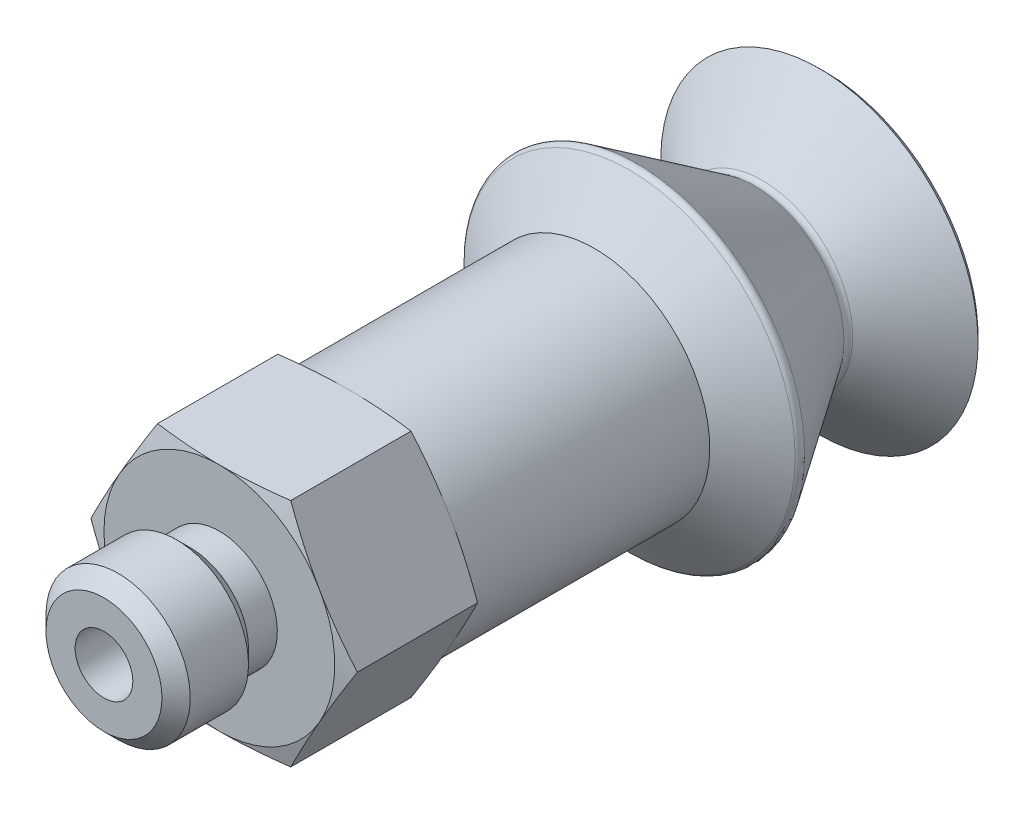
ISO-10303-21;
HEADER;
FILE_DESCRIPTION(('STEP AP214'),'2;1');
FILE_NAME('part.step','',(''),(''),'','','');
FILE_SCHEMA(('AUTOMOTIVE_DESIGN { 1 0 10303 214 1 1 1 1 }'));
ENDSEC;
DATA;
#1=APPLICATION_CONTEXT('core data for automotive mechanical design processes');
#2=APPLICATION_PROTOCOL_DEFINITION('international standard','automotive_design',2000,#1);
#3=PRODUCT_CONTEXT('',#1,'mechanical');
#4=PRODUCT('Part','Part','',(#3));
#5=PRODUCT_RELATED_PRODUCT_CATEGORY('part','',(#4));
#6=PRODUCT_DEFINITION_FORMATION('','',#4);
#7=PRODUCT_DEFINITION_CONTEXT('part definition',#1,'design');
#8=PRODUCT_DEFINITION('design','',#6,#7);
#9=PRODUCT_DEFINITION_SHAPE('','',#8);
#10=(LENGTH_UNIT() NAMED_UNIT(*) SI_UNIT(.MILLI.,.METRE.));
#11=(NAMED_UNIT(*) PLANE_ANGLE_UNIT() SI_UNIT($,.RADIAN.));
#12=(NAMED_UNIT(*) SI_UNIT($,.STERADIAN.) SOLID_ANGLE_UNIT());
#13=UNCERTAINTY_MEASURE_WITH_UNIT(LENGTH_MEASURE(1.E-05),#10,'distance_accuracy_value','');
#14=(GEOMETRIC_REPRESENTATION_CONTEXT(3) GLOBAL_UNCERTAINTY_ASSIGNED_CONTEXT((#13)) GLOBAL_UNIT_ASSIGNED_CONTEXT((#10,
#11,#12)) REPRESENTATION_CONTEXT('',''));
#15=CARTESIAN_POINT('',(0.,0.,0.));
#16=DIRECTION('',(0.,0.,1.));
#17=DIRECTION('',(1.,0.,0.));
#18=AXIS2_PLACEMENT_3D('',#15,#16,#17);
#19=CARTESIAN_POINT('',(4.61880215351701,0.,21.));
#20=DIRECTION('',(-0.866025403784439,-0.5,0.));
#21=DIRECTION('',(0.,0.,-1.));
#22=AXIS2_PLACEMENT_3D('',#19,#20,#21);
#23=PLANE('',#22);
#24=CARTESIAN_POINT('',(4.61880215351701,0.,16.6658075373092));
#25=CARTESIAN_POINT('',(4.0000000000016,1.07179676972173,16.5));
#26=CARTESIAN_POINT('',(3.46410161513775,2.00000000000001,16.5));
#27=B_SPLINE_CURVE_WITH_KNOTS('',2,(#24,#25,#26),.UNSPECIFIED.,.F.,.F.,(3,3),(0.,1.),.UNSPECIFIED.);
#28=CARTESIAN_POINT('',(4.61880215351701,0.,16.6658075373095));
#29=VERTEX_POINT('',#28);
#30=CARTESIAN_POINT('',(3.46410161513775,2.,16.5));
#31=VERTEX_POINT('',#30);
#32=EDGE_CURVE('E310',#29,#31,#27,.T.);
#33=ORIENTED_EDGE('',*,*,#32,.T.);
#34=CARTESIAN_POINT('',(3.46410161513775,2.00000000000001,16.5));
#35=CARTESIAN_POINT('',(2.92820323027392,2.92820323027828,16.5));
#36=CARTESIAN_POINT('',(2.30940107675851,4.,16.6658075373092));
#37=B_SPLINE_CURVE_WITH_KNOTS('',2,(#34,#35,#36),.UNSPECIFIED.,.F.,.F.,(3,3),(0.,1.),.UNSPECIFIED.);
#38=CARTESIAN_POINT('',(2.3094010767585,4.,16.6658075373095));
#39=VERTEX_POINT('',#38);
#40=EDGE_CURVE('E636',#31,#39,#37,.T.);
#41=ORIENTED_EDGE('',*,*,#40,.T.);
#42=DIRECTION('',(0.,0.,-1.));
#43=VECTOR('',#42,1.);
#44=CARTESIAN_POINT('',(2.3094010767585,4.,21.));
#45=LINE('',#44,#43);
#46=CARTESIAN_POINT('',(2.3094010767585,4.,20.8341924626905));
#47=VERTEX_POINT('',#46);
#48=EDGE_CURVE('E10',#47,#39,#45,.T.);
#49=ORIENTED_EDGE('',*,*,#48,.F.);
#50=CARTESIAN_POINT('',(2.30940107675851,4.,20.8341924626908));
#51=CARTESIAN_POINT('',(2.92820323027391,2.92820323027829,21.));
#52=CARTESIAN_POINT('',(3.46410161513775,2.00000000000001,21.));
#53=B_SPLINE_CURVE_WITH_KNOTS('',2,(#50,#51,#52),.UNSPECIFIED.,.F.,.F.,(3,3),(0.,1.),.UNSPECIFIED.);
#54=CARTESIAN_POINT('',(3.46410161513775,2.,21.));
#55=VERTEX_POINT('',#54);
#56=EDGE_CURVE('E224',#47,#55,#53,.T.);
#57=ORIENTED_EDGE('',*,*,#56,.T.);
#58=CARTESIAN_POINT('',(3.46410161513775,2.00000000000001,21.));
#59=CARTESIAN_POINT('',(4.00000000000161,1.07179676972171,21.));
#60=CARTESIAN_POINT('',(4.61880215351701,0.,20.8341924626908));
#61=B_SPLINE_CURVE_WITH_KNOTS('',2,(#58,#59,#60),.UNSPECIFIED.,.F.,.F.,(3,3),(0.,1.),.UNSPECIFIED.);
#62=CARTESIAN_POINT('',(4.61880215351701,0.,20.8341924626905));
#63=VERTEX_POINT('',#62);
#64=EDGE_CURVE('E272',#55,#63,#61,.T.);
#65=ORIENTED_EDGE('',*,*,#64,.T.);
#66=DIRECTION('',(0.,0.,-1.));
#67=VECTOR('',#66,1.);
#68=CARTESIAN_POINT('',(4.61880215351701,0.,21.));
#69=LINE('',#68,#67);
#70=EDGE_CURVE('E277',#63,#29,#69,.T.);
#71=ORIENTED_EDGE('',*,*,#70,.T.);
#72=EDGE_LOOP('',(#33,#41,#49,#57,#65,#71));
#73=FACE_BOUND('',#72,.T.);
#74=ADVANCED_FACE('F15',(#73),#23,.F.);
#75=CARTESIAN_POINT('',(2.3094010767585,4.,21.));
#76=DIRECTION('',(0.,-1.,0.));
#77=DIRECTION('',(0.,0.,-1.));
#78=AXIS2_PLACEMENT_3D('',#75,#76,#77);
#79=PLANE('',#78);
#80=CARTESIAN_POINT('',(2.3094010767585,4.,16.6658075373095));
#81=CARTESIAN_POINT('',(1.07179676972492,4.,16.5));
#82=CARTESIAN_POINT('',(0.,4.,16.5));
#83=B_SPLINE_CURVE_WITH_KNOTS('',2,(#80,#81,#82),.UNSPECIFIED.,.F.,.F.,(3,3),(0.,1.),.UNSPECIFIED.);
#84=CARTESIAN_POINT('',(0.,4.,16.5));
#85=VERTEX_POINT('',#84);
#86=EDGE_CURVE('E631',#39,#85,#83,.T.);
#87=ORIENTED_EDGE('',*,*,#86,.T.);
#88=CARTESIAN_POINT('',(0.,4.,16.5));
#89=CARTESIAN_POINT('',(-1.07179676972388,4.,16.5));
#90=CARTESIAN_POINT('',(-2.3094010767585,4.,16.6658075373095));
#91=B_SPLINE_CURVE_WITH_KNOTS('',2,(#88,#89,#90),.UNSPECIFIED.,.F.,.F.,(3,3),(0.,1.),.UNSPECIFIED.);
#92=CARTESIAN_POINT('',(-2.3094010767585,4.,16.6658075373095));
#93=VERTEX_POINT('',#92);
#94=EDGE_CURVE('E362',#85,#93,#91,.T.);
#95=ORIENTED_EDGE('',*,*,#94,.T.);
#96=DIRECTION('',(0.,0.,-1.));
#97=VECTOR('',#96,1.);
#98=CARTESIAN_POINT('',(-2.3094010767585,4.,21.));
#99=LINE('',#98,#97);
#100=CARTESIAN_POINT('',(-2.3094010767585,4.,20.8341924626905));
#101=VERTEX_POINT('',#100);
#102=EDGE_CURVE('E28',#101,#93,#99,.T.);
#103=ORIENTED_EDGE('',*,*,#102,.F.);
#104=CARTESIAN_POINT('',(-2.3094010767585,4.,20.8341924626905));
#105=CARTESIAN_POINT('',(-1.07179676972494,4.,21.));
#106=CARTESIAN_POINT('',(0.,4.,21.));
#107=B_SPLINE_CURVE_WITH_KNOTS('',2,(#104,#105,#106),.UNSPECIFIED.,.F.,.F.,(3,3),(0.,1.),.UNSPECIFIED.);
#108=CARTESIAN_POINT('',(0.,4.,21.));
#109=VERTEX_POINT('',#108);
#110=EDGE_CURVE('E414',#101,#109,#107,.T.);
#111=ORIENTED_EDGE('',*,*,#110,.T.);
#112=CARTESIAN_POINT('',(0.,4.,21.));
#113=CARTESIAN_POINT('',(1.07179676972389,4.,21.));
#114=CARTESIAN_POINT('',(2.30940107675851,4.,20.8341924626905));
#115=B_SPLINE_CURVE_WITH_KNOTS('',2,(#112,#113,#114),.UNSPECIFIED.,.F.,.F.,(3,3),(0.,1.),.UNSPECIFIED.);
#116=EDGE_CURVE('E756',#109,#47,#115,.T.);
#117=ORIENTED_EDGE('',*,*,#116,.T.);
#118=ORIENTED_EDGE('',*,*,#48,.T.);
#119=EDGE_LOOP('',(#87,#95,#103,#111,#117,#118));
#120=FACE_BOUND('',#119,.T.);
#121=ADVANCED_FACE('F240',(#120),#79,.F.);
#122=CARTESIAN_POINT('',(-2.3094010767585,4.,21.));
#123=DIRECTION('',(0.866025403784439,-0.5,0.));
#124=DIRECTION('',(0.5,0.866025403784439,0.));
#125=AXIS2_PLACEMENT_3D('',#122,#123,#124);
#126=PLANE('',#125);
#127=CARTESIAN_POINT('',(-2.3094010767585,4.,16.6658075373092));
#128=CARTESIAN_POINT('',(-2.92820323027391,2.92820323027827,16.5));
#129=CARTESIAN_POINT('',(-3.46410161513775,1.99999999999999,16.5));
#130=B_SPLINE_CURVE_WITH_KNOTS('',2,(#127,#128,#129),.UNSPECIFIED.,.F.,.F.,(3,3),(0.,1.),.UNSPECIFIED.);
#131=CARTESIAN_POINT('',(-3.46410161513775,2.,16.5));
#132=VERTEX_POINT('',#131);
#133=EDGE_CURVE('E540',#93,#132,#130,.T.);
#134=ORIENTED_EDGE('',*,*,#133,.T.);
#135=CARTESIAN_POINT('',(-3.46410161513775,2.,16.5));
#136=CARTESIAN_POINT('',(-4.0000000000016,1.07179676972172,16.5));
#137=CARTESIAN_POINT('',(-4.618802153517,0.,16.6658075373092));
#138=B_SPLINE_CURVE_WITH_KNOTS('',2,(#135,#136,#137),.UNSPECIFIED.,.F.,.F.,(3,3),(0.,1.),.UNSPECIFIED.);
#139=CARTESIAN_POINT('',(-4.61880215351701,0.,16.6658075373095));
#140=VERTEX_POINT('',#139);
#141=EDGE_CURVE('E554',#132,#140,#138,.T.);
#142=ORIENTED_EDGE('',*,*,#141,.T.);
#143=DIRECTION('',(0.,0.,-1.));
#144=VECTOR('',#143,1.);
#145=CARTESIAN_POINT('',(-4.61880215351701,0.,21.));
#146=LINE('',#145,#144);
#147=CARTESIAN_POINT('',(-4.61880215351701,0.,20.8341924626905));
#148=VERTEX_POINT('',#147);
#149=EDGE_CURVE('E491',#148,#140,#146,.T.);
#150=ORIENTED_EDGE('',*,*,#149,.F.);
#151=CARTESIAN_POINT('',(-4.618802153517,0.,20.8341924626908));
#152=CARTESIAN_POINT('',(-4.0000000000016,1.07179676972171,21.));
#153=CARTESIAN_POINT('',(-3.46410161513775,2.,21.));
#154=B_SPLINE_CURVE_WITH_KNOTS('',2,(#151,#152,#153),.UNSPECIFIED.,.F.,.F.,(3,3),(0.,1.),.UNSPECIFIED.);
#155=CARTESIAN_POINT('',(-3.46410161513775,2.,21.));
#156=VERTEX_POINT('',#155);
#157=EDGE_CURVE('E501',#148,#156,#154,.T.);
#158=ORIENTED_EDGE('',*,*,#157,.T.);
#159=CARTESIAN_POINT('',(-3.46410161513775,2.,21.));
#160=CARTESIAN_POINT('',(-2.9282032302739,2.9282032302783,21.));
#161=CARTESIAN_POINT('',(-2.3094010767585,4.,20.8341924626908));
#162=B_SPLINE_CURVE_WITH_KNOTS('',2,(#159,#160,#161),.UNSPECIFIED.,.F.,.F.,(3,3),(0.,1.),.UNSPECIFIED.);
#163=EDGE_CURVE('E454',#156,#101,#162,.T.);
#164=ORIENTED_EDGE('',*,*,#163,.T.);
#165=ORIENTED_EDGE('',*,*,#102,.T.);
#166=EDGE_LOOP('',(#134,#142,#150,#158,#164,#165));
#167=FACE_BOUND('',#166,.T.);
#168=ADVANCED_FACE('F378',(#167),#126,.F.);
#169=CARTESIAN_POINT('',(-4.61880215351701,0.,21.));
#170=DIRECTION('',(0.866025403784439,0.5,0.));
#171=DIRECTION('',(0.,0.,1.));
#172=AXIS2_PLACEMENT_3D('',#169,#170,#171);
#173=PLANE('',#172);
#174=CARTESIAN_POINT('',(-4.61880215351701,0.,16.6658075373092));
#175=CARTESIAN_POINT('',(-4.0000000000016,-1.07179676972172,16.5));
#176=CARTESIAN_POINT('',(-3.46410161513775,-2.00000000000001,16.5));
#177=B_SPLINE_CURVE_WITH_KNOTS('',2,(#174,#175,#176),.UNSPECIFIED.,.F.,.F.,(3,3),(0.,1.),.UNSPECIFIED.);
#178=CARTESIAN_POINT('',(-3.46410161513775,-2.,16.5));
#179=VERTEX_POINT('',#178);
#180=EDGE_CURVE('E553',#140,#179,#177,.T.);
#181=ORIENTED_EDGE('',*,*,#180,.T.);
#182=CARTESIAN_POINT('',(-3.46410161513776,-2.,16.5));
#183=CARTESIAN_POINT('',(-2.92820323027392,-2.92820323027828,16.5));
#184=CARTESIAN_POINT('',(-2.30940107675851,-4.,16.6658075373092));
#185=B_SPLINE_CURVE_WITH_KNOTS('',2,(#182,#183,#184),.UNSPECIFIED.,.F.,.F.,(3,3),(0.,1.),.UNSPECIFIED.);
#186=CARTESIAN_POINT('',(-2.3094010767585,-4.,16.6658075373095));
#187=VERTEX_POINT('',#186);
#188=EDGE_CURVE('E698',#179,#187,#185,.T.);
#189=ORIENTED_EDGE('',*,*,#188,.T.);
#190=DIRECTION('',(0.,0.,-1.));
#191=VECTOR('',#190,1.);
#192=CARTESIAN_POINT('',(-2.3094010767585,-4.,21.));
#193=LINE('',#192,#191);
#194=CARTESIAN_POINT('',(-2.3094010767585,-4.,20.8341924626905));
#195=VERTEX_POINT('',#194);
#196=EDGE_CURVE('E494',#195,#187,#193,.T.);
#197=ORIENTED_EDGE('',*,*,#196,.F.);
#198=CARTESIAN_POINT('',(-2.30940107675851,-4.,20.8341924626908));
#199=CARTESIAN_POINT('',(-2.92820323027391,-2.92820323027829,21.));
#200=CARTESIAN_POINT('',(-3.46410161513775,-2.00000000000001,21.));
#201=B_SPLINE_CURVE_WITH_KNOTS('',2,(#198,#199,#200),.UNSPECIFIED.,.F.,.F.,(3,3),(0.,1.),.UNSPECIFIED.);
#202=CARTESIAN_POINT('',(-3.46410161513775,-2.,21.));
#203=VERTEX_POINT('',#202);
#204=EDGE_CURVE('E487',#195,#203,#201,.T.);
#205=ORIENTED_EDGE('',*,*,#204,.T.);
#206=CARTESIAN_POINT('',(-3.46410161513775,-2.00000000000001,21.));
#207=CARTESIAN_POINT('',(-4.00000000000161,-1.07179676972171,21.));
#208=CARTESIAN_POINT('',(-4.61880215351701,0.,20.8341924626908));
#209=B_SPLINE_CURVE_WITH_KNOTS('',2,(#206,#207,#208),.UNSPECIFIED.,.F.,.F.,(3,3),(0.,1.),.UNSPECIFIED.);
#210=EDGE_CURVE('E455',#203,#148,#209,.T.);
#211=ORIENTED_EDGE('',*,*,#210,.T.);
#212=ORIENTED_EDGE('',*,*,#149,.T.);
#213=EDGE_LOOP('',(#181,#189,#197,#205,#211,#212));
#214=FACE_BOUND('',#213,.T.);
#215=ADVANCED_FACE('F433',(#214),#173,.F.);
#216=CARTESIAN_POINT('',(-2.3094010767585,-4.,21.));
#217=DIRECTION('',(0.,1.,0.));
#218=DIRECTION('',(-1.,0.,0.));
#219=AXIS2_PLACEMENT_3D('',#216,#217,#218);
#220=PLANE('',#219);
#221=CARTESIAN_POINT('',(-2.3094010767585,-4.,16.6658075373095));
#222=CARTESIAN_POINT('',(-1.07179676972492,-4.,16.5));
#223=CARTESIAN_POINT('',(0.,-4.,16.5));
#224=B_SPLINE_CURVE_WITH_KNOTS('',2,(#221,#222,#223),.UNSPECIFIED.,.F.,.F.,(3,3),(0.,1.),.UNSPECIFIED.);
#225=CARTESIAN_POINT('',(0.,-4.,16.5));
#226=VERTEX_POINT('',#225);
#227=EDGE_CURVE('E1159',#187,#226,#224,.T.);
#228=ORIENTED_EDGE('',*,*,#227,.T.);
#229=CARTESIAN_POINT('',(0.,-4.,16.5));
#230=CARTESIAN_POINT('',(1.07179676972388,-4.,16.5));
#231=CARTESIAN_POINT('',(2.3094010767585,-4.,16.6658075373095));
#232=B_SPLINE_CURVE_WITH_KNOTS('',2,(#229,#230,#231),.UNSPECIFIED.,.F.,.F.,(3,3),(0.,1.),.UNSPECIFIED.);
#233=CARTESIAN_POINT('',(2.3094010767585,-4.,16.6658075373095));
#234=VERTEX_POINT('',#233);
#235=EDGE_CURVE('E355',#226,#234,#232,.T.);
#236=ORIENTED_EDGE('',*,*,#235,.T.);
#237=DIRECTION('',(0.,0.,-1.));
#238=VECTOR('',#237,1.);
#239=CARTESIAN_POINT('',(2.3094010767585,-4.,21.));
#240=LINE('',#239,#238);
#241=CARTESIAN_POINT('',(2.3094010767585,-4.,20.8341924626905));
#242=VERTEX_POINT('',#241);
#243=EDGE_CURVE('E693',#242,#234,#240,.T.);
#244=ORIENTED_EDGE('',*,*,#243,.F.);
#245=CARTESIAN_POINT('',(2.3094010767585,-4.,20.8341924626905));
#246=CARTESIAN_POINT('',(1.07179676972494,-4.,21.));
#247=CARTESIAN_POINT('',(0.,-4.,21.));
#248=B_SPLINE_CURVE_WITH_KNOTS('',2,(#245,#246,#247),.UNSPECIFIED.,.F.,.F.,(3,3),(0.,1.),.UNSPECIFIED.);
#249=CARTESIAN_POINT('',(0.,-4.,21.));
#250=VERTEX_POINT('',#249);
#251=EDGE_CURVE('E691',#242,#250,#248,.T.);
#252=ORIENTED_EDGE('',*,*,#251,.T.);
#253=CARTESIAN_POINT('',(0.,-4.,21.));
#254=CARTESIAN_POINT('',(-1.07179676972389,-4.,21.));
#255=CARTESIAN_POINT('',(-2.30940107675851,-4.,20.8341924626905));
#256=B_SPLINE_CURVE_WITH_KNOTS('',2,(#253,#254,#255),.UNSPECIFIED.,.F.,.F.,(3,3),(0.,1.),.UNSPECIFIED.);
#257=EDGE_CURVE('E488',#250,#195,#256,.T.);
#258=ORIENTED_EDGE('',*,*,#257,.T.);
#259=ORIENTED_EDGE('',*,*,#196,.T.);
#260=EDGE_LOOP('',(#228,#236,#244,#252,#258,#259));
#261=FACE_BOUND('',#260,.T.);
#262=ADVANCED_FACE('F379',(#261),#220,.F.);
#263=CARTESIAN_POINT('',(2.3094010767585,-4.,21.));
#264=DIRECTION('',(-0.866025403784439,0.5,0.));
#265=DIRECTION('',(0.,0.,-1.));
#266=AXIS2_PLACEMENT_3D('',#263,#264,#265);
#267=PLANE('',#266);
#268=CARTESIAN_POINT('',(2.3094010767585,-4.,16.6658075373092));
#269=CARTESIAN_POINT('',(2.92820323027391,-2.92820323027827,16.5));
#270=CARTESIAN_POINT('',(3.46410161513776,-2.,16.5));
#271=B_SPLINE_CURVE_WITH_KNOTS('',2,(#268,#269,#270),.UNSPECIFIED.,.F.,.F.,(3,3),(0.,1.),.UNSPECIFIED.);
#272=CARTESIAN_POINT('',(3.46410161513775,-2.,16.5));
#273=VERTEX_POINT('',#272);
#274=EDGE_CURVE('E354',#234,#273,#271,.T.);
#275=ORIENTED_EDGE('',*,*,#274,.T.);
#276=CARTESIAN_POINT('',(3.46410161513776,-2.,16.5));
#277=CARTESIAN_POINT('',(4.0000000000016,-1.07179676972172,16.5));
#278=CARTESIAN_POINT('',(4.61880215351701,0.,16.6658075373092));
#279=B_SPLINE_CURVE_WITH_KNOTS('',2,(#276,#277,#278),.UNSPECIFIED.,.F.,.F.,(3,3),(0.,1.),.UNSPECIFIED.);
#280=EDGE_CURVE('E616',#273,#29,#279,.T.);
#281=ORIENTED_EDGE('',*,*,#280,.T.);
#282=ORIENTED_EDGE('',*,*,#70,.F.);
#283=CARTESIAN_POINT('',(4.61880215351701,0.,20.8341924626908));
#284=CARTESIAN_POINT('',(4.00000000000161,-1.07179676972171,21.));
#285=CARTESIAN_POINT('',(3.46410161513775,-2.,21.));
#286=B_SPLINE_CURVE_WITH_KNOTS('',2,(#283,#284,#285),.UNSPECIFIED.,.F.,.F.,(3,3),(0.,1.),.UNSPECIFIED.);
#287=CARTESIAN_POINT('',(3.46410161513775,-2.,21.));
#288=VERTEX_POINT('',#287);
#289=EDGE_CURVE('E601',#63,#288,#286,.T.);
#290=ORIENTED_EDGE('',*,*,#289,.T.);
#291=CARTESIAN_POINT('',(3.46410161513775,-2.,21.));
#292=CARTESIAN_POINT('',(2.9282032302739,-2.92820323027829,21.));
#293=CARTESIAN_POINT('',(2.3094010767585,-4.,20.8341924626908));
#294=B_SPLINE_CURVE_WITH_KNOTS('',2,(#291,#292,#293),.UNSPECIFIED.,.F.,.F.,(3,3),(0.,1.),.UNSPECIFIED.);
#295=EDGE_CURVE('E604',#288,#242,#294,.T.);
#296=ORIENTED_EDGE('',*,*,#295,.T.);
#297=ORIENTED_EDGE('',*,*,#243,.T.);
#298=EDGE_LOOP('',(#275,#281,#282,#290,#296,#297));
#299=FACE_BOUND('',#298,.T.);
#300=ADVANCED_FACE('F566',(#299),#267,.F.);
#301=CARTESIAN_POINT('',(-2.0095,0.,25.));
#302=DIRECTION('',(0.,0.,1.));
#303=DIRECTION('',(-1.,0.,0.));
#304=AXIS2_PLACEMENT_3D('',#301,#302,#303);
#305=PLANE('',#304);
#306=CARTESIAN_POINT('',(0.,0.,25.));
#307=DIRECTION('',(0.,0.,-1.));
#308=DIRECTION('',(0.,-1.,0.));
#309=AXIS2_PLACEMENT_3D('',#306,#307,#308);
#310=CIRCLE('',#309,2.0095);
#311=CARTESIAN_POINT('',(0.,-2.0095,25.));
#312=VERTEX_POINT('',#311);
#313=EDGE_CURVE('E40',#312,#312,#310,.T.);
#314=ORIENTED_EDGE('',*,*,#313,.F.);
#315=EDGE_LOOP('',(#314));
#316=FACE_BOUND('',#315,.T.);
#317=CARTESIAN_POINT('',(0.,0.,25.));
#318=DIRECTION('',(0.,0.,-1.));
#319=DIRECTION('',(0.,-1.,0.));
#320=AXIS2_PLACEMENT_3D('',#317,#318,#319);
#321=CIRCLE('',#320,1.);
#322=CARTESIAN_POINT('',(0.,-1.,25.));
#323=VERTEX_POINT('',#322);
#324=EDGE_CURVE('E637',#323,#323,#321,.T.);
#325=ORIENTED_EDGE('',*,*,#324,.T.);
#326=EDGE_LOOP('',(#325));
#327=FACE_BOUND('',#326,.T.);
#328=ADVANCED_FACE('F575',(#316,#327),#305,.T.);
#329=CARTESIAN_POINT('',(0.,0.,24.5095));
#330=DIRECTION('',(0.,0.,-1.));
#331=DIRECTION('',(0.,-1.,0.));
#332=AXIS2_PLACEMENT_3D('',#329,#330,#331);
#333=CONICAL_SURFACE('',#332,2.5,0.785398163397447);
#334=CARTESIAN_POINT('',(0.,0.,24.5095));
#335=DIRECTION('',(0.,0.,-1.));
#336=DIRECTION('',(0.,-1.,0.));
#337=AXIS2_PLACEMENT_3D('',#334,#335,#336);
#338=CIRCLE('',#337,2.5);
#339=CARTESIAN_POINT('',(0.,-2.5,24.5095));
#340=VERTEX_POINT('',#339);
#341=EDGE_CURVE('E673',#340,#340,#338,.T.);
#342=ORIENTED_EDGE('',*,*,#341,.F.);
#343=EDGE_LOOP('',(#342));
#344=FACE_BOUND('',#343,.T.);
#345=ORIENTED_EDGE('',*,*,#313,.T.);
#346=EDGE_LOOP('',(#345));
#347=FACE_BOUND('',#346,.T.);
#348=ADVANCED_FACE('F840',(#344,#347),#333,.T.);
#349=CARTESIAN_POINT('',(0.,0.,16.5));
#350=DIRECTION('',(0.,0.,-1.));
#351=DIRECTION('',(0.,-1.,0.));
#352=AXIS2_PLACEMENT_3D('',#349,#350,#351);
#353=CYLINDRICAL_SURFACE('',#352,2.5);
#354=CARTESIAN_POINT('',(0.,0.,22.4905));
#355=DIRECTION('',(0.,0.,-1.));
#356=DIRECTION('',(0.,-1.,0.));
#357=AXIS2_PLACEMENT_3D('',#354,#355,#356);
#358=CIRCLE('',#357,2.5);
#359=CARTESIAN_POINT('',(0.,-2.5,22.4905));
#360=VERTEX_POINT('',#359);
#361=EDGE_CURVE('E1121',#360,#360,#358,.T.);
#362=ORIENTED_EDGE('',*,*,#361,.F.);
#363=EDGE_LOOP('',(#362));
#364=FACE_BOUND('',#363,.T.);
#365=ORIENTED_EDGE('',*,*,#341,.T.);
#366=EDGE_LOOP('',(#365));
#367=FACE_BOUND('',#366,.T.);
#368=ADVANCED_FACE('F834',(#364,#367),#353,.T.);
#369=CARTESIAN_POINT('',(0.,0.,22.));
#370=DIRECTION('',(0.,0.,1.));
#371=DIRECTION('',(0.,1.,0.));
#372=AXIS2_PLACEMENT_3D('',#369,#370,#371);
#373=CONICAL_SURFACE('',#372,2.0095,0.785398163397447);
#374=CARTESIAN_POINT('',(0.,0.,22.));
#375=DIRECTION('',(0.,0.,-1.));
#376=DIRECTION('',(0.,-1.,0.));
#377=AXIS2_PLACEMENT_3D('',#374,#375,#376);
#378=CIRCLE('',#377,2.0095);
#379=CARTESIAN_POINT('',(0.,-2.0095,22.));
#380=VERTEX_POINT('',#379);
#381=EDGE_CURVE('E711',#380,#380,#378,.T.);
#382=ORIENTED_EDGE('',*,*,#381,.F.);
#383=EDGE_LOOP('',(#382));
#384=FACE_BOUND('',#383,.T.);
#385=ORIENTED_EDGE('',*,*,#361,.T.);
#386=EDGE_LOOP('',(#385));
#387=FACE_BOUND('',#386,.T.);
#388=ADVANCED_FACE('F839',(#384,#387),#373,.T.);
#389=CARTESIAN_POINT('',(0.,0.,16.5));
#390=DIRECTION('',(0.,0.,-1.));
#391=DIRECTION('',(0.,-1.,0.));
#392=AXIS2_PLACEMENT_3D('',#389,#390,#391);
#393=CYLINDRICAL_SURFACE('',#392,2.0095);
#394=CARTESIAN_POINT('',(0.,0.,21.));
#395=DIRECTION('',(0.,0.,-1.));
#396=DIRECTION('',(0.,-1.,0.));
#397=AXIS2_PLACEMENT_3D('',#394,#395,#396);
#398=CIRCLE('',#397,2.0095);
#399=CARTESIAN_POINT('',(0.,-2.0095,21.));
#400=VERTEX_POINT('',#399);
#401=EDGE_CURVE('E707',#400,#400,#398,.T.);
#402=ORIENTED_EDGE('',*,*,#401,.F.);
#403=EDGE_LOOP('',(#402));
#404=FACE_BOUND('',#403,.T.);
#405=ORIENTED_EDGE('',*,*,#381,.T.);
#406=EDGE_LOOP('',(#405));
#407=FACE_BOUND('',#406,.T.);
#408=ADVANCED_FACE('F875',(#404,#407),#393,.T.);
#409=CARTESIAN_POINT('',(-4.,0.,21.));
#410=DIRECTION('',(0.,0.,1.));
#411=DIRECTION('',(-1.,0.,0.));
#412=AXIS2_PLACEMENT_3D('',#409,#410,#411);
#413=PLANE('',#412);
#414=CARTESIAN_POINT('',(0.,0.,21.));
#415=DIRECTION('',(0.,0.,-1.));
#416=DIRECTION('',(0.,-1.,0.));
#417=AXIS2_PLACEMENT_3D('',#414,#415,#416);
#418=CIRCLE('',#417,4.);
#419=EDGE_CURVE('E445',#203,#156,#418,.T.);
#420=ORIENTED_EDGE('',*,*,#419,.F.);
#421=CARTESIAN_POINT('',(0.,0.,21.));
#422=DIRECTION('',(0.,0.,-1.));
#423=DIRECTION('',(0.,-1.,0.));
#424=AXIS2_PLACEMENT_3D('',#421,#422,#423);
#425=CIRCLE('',#424,4.);
#426=EDGE_CURVE('E478',#250,#203,#425,.T.);
#427=ORIENTED_EDGE('',*,*,#426,.F.);
#428=CARTESIAN_POINT('',(0.,0.,21.));
#429=DIRECTION('',(0.,0.,-1.));
#430=DIRECTION('',(0.,-1.,0.));
#431=AXIS2_PLACEMENT_3D('',#428,#429,#430);
#432=CIRCLE('',#431,4.);
#433=EDGE_CURVE('E1131',#288,#250,#432,.T.);
#434=ORIENTED_EDGE('',*,*,#433,.F.);
#435=CARTESIAN_POINT('',(0.,0.,21.));
#436=DIRECTION('',(0.,0.,-1.));
#437=DIRECTION('',(0.,-1.,0.));
#438=AXIS2_PLACEMENT_3D('',#435,#436,#437);
#439=CIRCLE('',#438,4.);
#440=EDGE_CURVE('E609',#55,#288,#439,.T.);
#441=ORIENTED_EDGE('',*,*,#440,.F.);
#442=CARTESIAN_POINT('',(0.,0.,21.));
#443=DIRECTION('',(0.,0.,-1.));
#444=DIRECTION('',(0.,-1.,0.));
#445=AXIS2_PLACEMENT_3D('',#442,#443,#444);
#446=CIRCLE('',#445,4.);
#447=EDGE_CURVE('E764',#109,#55,#446,.T.);
#448=ORIENTED_EDGE('',*,*,#447,.F.);
#449=CARTESIAN_POINT('',(0.,0.,21.));
#450=DIRECTION('',(0.,0.,-1.));
#451=DIRECTION('',(0.,-1.,0.));
#452=AXIS2_PLACEMENT_3D('',#449,#450,#451);
#453=CIRCLE('',#452,4.);
#454=EDGE_CURVE('E665',#156,#109,#453,.T.);
#455=ORIENTED_EDGE('',*,*,#454,.F.);
#456=EDGE_LOOP('',(#420,#427,#434,#441,#448,#455));
#457=FACE_BOUND('',#456,.T.);
#458=ORIENTED_EDGE('',*,*,#401,.T.);
#459=EDGE_LOOP('',(#458));
#460=FACE_BOUND('',#459,.T.);
#461=ADVANCED_FACE('F781',(#457,#460),#413,.T.);
#462=CARTESIAN_POINT('',(0.,0.,20.7856406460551));
#463=DIRECTION('',(0.,0.,-1.));
#464=DIRECTION('',(0.,-1.,0.));
#465=AXIS2_PLACEMENT_3D('',#462,#463,#464);
#466=CONICAL_SURFACE('',#465,4.8,1.30899693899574);
#467=ORIENTED_EDGE('',*,*,#116,.F.);
#468=ORIENTED_EDGE('',*,*,#447,.T.);
#469=ORIENTED_EDGE('',*,*,#56,.F.);
#470=EDGE_LOOP('',(#467,#468,#469));
#471=FACE_BOUND('',#470,.T.);
#472=ADVANCED_FACE('F776',(#471),#466,.T.);
#473=CARTESIAN_POINT('',(0.,0.,16.5));
#474=DIRECTION('',(0.,0.,1.));
#475=DIRECTION('',(0.,1.,0.));
#476=AXIS2_PLACEMENT_3D('',#473,#474,#475);
#477=CONICAL_SURFACE('',#476,4.,1.30899693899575);
#478=ORIENTED_EDGE('',*,*,#86,.F.);
#479=ORIENTED_EDGE('',*,*,#40,.F.);
#480=CARTESIAN_POINT('',(0.,0.,16.5));
#481=DIRECTION('',(0.,0.,-1.));
#482=DIRECTION('',(0.,-1.,0.));
#483=AXIS2_PLACEMENT_3D('',#480,#481,#482);
#484=CIRCLE('',#483,4.);
#485=EDGE_CURVE('E218',#85,#31,#484,.T.);
#486=ORIENTED_EDGE('',*,*,#485,.F.);
#487=EDGE_LOOP('',(#478,#479,#486));
#488=FACE_BOUND('',#487,.T.);
#489=ADVANCED_FACE('F292',(#488),#477,.T.);
#490=CARTESIAN_POINT('',(-1.,0.,16.5));
#491=DIRECTION('',(0.,0.,-1.));
#492=DIRECTION('',(0.,-1.,0.));
#493=AXIS2_PLACEMENT_3D('',#490,#491,#492);
#494=PLANE('',#493);
#495=CARTESIAN_POINT('',(0.,0.,16.5));
#496=DIRECTION('',(0.,0.,-1.));
#497=DIRECTION('',(0.,-1.,0.));
#498=AXIS2_PLACEMENT_3D('',#495,#496,#497);
#499=CIRCLE('',#498,1.);
#500=CARTESIAN_POINT('',(0.,-1.,16.5));
#501=VERTEX_POINT('',#500);
#502=EDGE_CURVE('E640',#501,#501,#499,.T.);
#503=ORIENTED_EDGE('',*,*,#502,.F.);
#504=EDGE_LOOP('',(#503));
#505=FACE_BOUND('',#504,.T.);
#506=CARTESIAN_POINT('',(0.,0.,16.5));
#507=DIRECTION('',(0.,0.,-1.));
#508=DIRECTION('',(0.,-1.,0.));
#509=AXIS2_PLACEMENT_3D('',#506,#507,#508);
#510=CIRCLE('',#509,2.);
#511=CARTESIAN_POINT('',(0.,-2.,16.5));
#512=VERTEX_POINT('',#511);
#513=EDGE_CURVE('E741',#512,#512,#510,.T.);
#514=ORIENTED_EDGE('',*,*,#513,.T.);
#515=EDGE_LOOP('',(#514));
#516=FACE_BOUND('',#515,.T.);
#517=ADVANCED_FACE('F516',(#505,#516),#494,.T.);
#518=CARTESIAN_POINT('',(0.,0.,16.5));
#519=DIRECTION('',(0.,0.,-1.));
#520=DIRECTION('',(0.,-1.,0.));
#521=AXIS2_PLACEMENT_3D('',#518,#519,#520);
#522=CYLINDRICAL_SURFACE('',#521,1.);
#523=ORIENTED_EDGE('',*,*,#324,.F.);
#524=EDGE_LOOP('',(#523));
#525=FACE_BOUND('',#524,.T.);
#526=ORIENTED_EDGE('',*,*,#502,.T.);
#527=EDGE_LOOP('',(#526));
#528=FACE_BOUND('',#527,.T.);
#529=ADVANCED_FACE('F958',(#525,#528),#522,.F.);
#530=CARTESIAN_POINT('',(0.,0.,0.));
#531=DIRECTION('',(0.,0.,-1.));
#532=DIRECTION('',(0.,-1.,0.));
#533=AXIS2_PLACEMENT_3D('',#530,#531,#532);
#534=CYLINDRICAL_SURFACE('',#533,4.);
#535=CARTESIAN_POINT('',(0.,0.,8.));
#536=DIRECTION('',(0.,0.,-1.));
#537=DIRECTION('',(0.,-1.,0.));
#538=AXIS2_PLACEMENT_3D('',#535,#536,#537);
#539=CIRCLE('',#538,4.);
#540=CARTESIAN_POINT('',(0.,-4.,8.));
#541=VERTEX_POINT('',#540);
#542=EDGE_CURVE('E216',#541,#541,#539,.T.);
#543=ORIENTED_EDGE('',*,*,#542,.F.);
#544=EDGE_LOOP('',(#543));
#545=FACE_BOUND('',#544,.T.);
#546=CARTESIAN_POINT('',(0.,0.,16.5));
#547=DIRECTION('',(0.,0.,-1.));
#548=DIRECTION('',(0.,-1.,0.));
#549=AXIS2_PLACEMENT_3D('',#546,#547,#548);
#550=CIRCLE('',#549,4.);
#551=EDGE_CURVE('E702',#226,#179,#550,.T.);
#552=ORIENTED_EDGE('',*,*,#551,.T.);
#553=CARTESIAN_POINT('',(0.,0.,16.5));
#554=DIRECTION('',(0.,0.,-1.));
#555=DIRECTION('',(0.,-1.,0.));
#556=AXIS2_PLACEMENT_3D('',#553,#554,#555);
#557=CIRCLE('',#556,4.);
#558=EDGE_CURVE('E544',#179,#132,#557,.T.);
#559=ORIENTED_EDGE('',*,*,#558,.T.);
#560=CARTESIAN_POINT('',(0.,0.,16.5));
#561=DIRECTION('',(0.,0.,-1.));
#562=DIRECTION('',(0.,-1.,0.));
#563=AXIS2_PLACEMENT_3D('',#560,#561,#562);
#564=CIRCLE('',#563,4.);
#565=EDGE_CURVE('E624',#132,#85,#564,.T.);
#566=ORIENTED_EDGE('',*,*,#565,.T.);
#567=ORIENTED_EDGE('',*,*,#485,.T.);
#568=CARTESIAN_POINT('',(0.,0.,16.5));
#569=DIRECTION('',(0.,0.,-1.));
#570=DIRECTION('',(0.,-1.,0.));
#571=AXIS2_PLACEMENT_3D('',#568,#569,#570);
#572=CIRCLE('',#571,4.);
#573=EDGE_CURVE('E611',#31,#273,#572,.T.);
#574=ORIENTED_EDGE('',*,*,#573,.T.);
#575=CARTESIAN_POINT('',(0.,0.,16.5));
#576=DIRECTION('',(0.,0.,-1.));
#577=DIRECTION('',(0.,-1.,0.));
#578=AXIS2_PLACEMENT_3D('',#575,#576,#577);
#579=CIRCLE('',#578,4.);
#580=EDGE_CURVE('E346',#273,#226,#579,.T.);
#581=ORIENTED_EDGE('',*,*,#580,.T.);
#582=EDGE_LOOP('',(#552,#559,#566,#567,#574,#581));
#583=FACE_BOUND('',#582,.T.);
#584=ADVANCED_FACE('F642',(#545,#583),#534,.T.);
#585=CARTESIAN_POINT('',(0.,0.,6.78146891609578));
#586=DIRECTION('',(0.,0.,-1.));
#587=DIRECTION('',(0.,-1.,0.));
#588=AXIS2_PLACEMENT_3D('',#585,#586,#587);
#589=CONICAL_SURFACE('',#588,5.74024273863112,0.959931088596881);
#590=CARTESIAN_POINT('',(0.,0.,6.78146891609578));
#591=DIRECTION('',(0.,0.,-1.));
#592=DIRECTION('',(0.,-1.,0.));
#593=AXIS2_PLACEMENT_3D('',#590,#591,#592);
#594=CIRCLE('',#593,5.74024273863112);
#595=CARTESIAN_POINT('',(0.,-5.74024273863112,6.78146891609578));
#596=VERTEX_POINT('',#595);
#597=EDGE_CURVE('E213',#596,#596,#594,.T.);
#598=ORIENTED_EDGE('',*,*,#597,.F.);
#599=EDGE_LOOP('',(#598));
#600=FACE_BOUND('',#599,.T.);
#601=ORIENTED_EDGE('',*,*,#542,.T.);
#602=EDGE_LOOP('',(#601));
#603=FACE_BOUND('',#602,.T.);
#604=ADVANCED_FACE('F337',(#600,#603),#589,.T.);
#605=CARTESIAN_POINT('',(0.,0.,6.61763850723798));
#606=DIRECTION('',(0.,0.,-1.));
#607=DIRECTION('',(0.,-1.,0.));
#608=AXIS2_PLACEMENT_3D('',#605,#606,#607);
#609=TOROIDAL_SURFACE('',#608,5.62552745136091,0.2);
#610=CARTESIAN_POINT('',(0.,0.,6.50708333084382));
#611=DIRECTION('',(0.,0.,-1.));
#612=DIRECTION('',(0.,-1.,0.));
#613=AXIS2_PLACEMENT_3D('',#610,#611,#612);
#614=CIRCLE('',#613,5.79219344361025);
#615=CARTESIAN_POINT('',(0.,-5.79219344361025,6.50708333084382));
#616=VERTEX_POINT('',#615);
#617=EDGE_CURVE('E206',#616,#616,#614,.T.);
#618=ORIENTED_EDGE('',*,*,#617,.F.);
#619=EDGE_LOOP('',(#618));
#620=FACE_BOUND('',#619,.T.);
#621=ORIENTED_EDGE('',*,*,#597,.T.);
#622=EDGE_LOOP('',(#621));
#623=FACE_BOUND('',#622,.T.);
#624=ADVANCED_FACE('F823',(#620,#623),#609,.T.);
#625=CARTESIAN_POINT('',(0.,0.,2.44665489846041));
#626=DIRECTION('',(0.,0.,1.));
#627=DIRECTION('',(0.,1.,0.));
#628=AXIS2_PLACEMENT_3D('',#625,#626,#627);
#629=CONICAL_SURFACE('',#628,3.0987742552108,0.585691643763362);
#630=CARTESIAN_POINT('',(0.,0.,2.44665489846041));
#631=DIRECTION('',(0.,0.,-1.));
#632=DIRECTION('',(0.,-1.,0.));
#633=AXIS2_PLACEMENT_3D('',#630,#631,#632);
#634=CIRCLE('',#633,3.0987742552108);
#635=CARTESIAN_POINT('',(0.,-3.0987742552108,2.44665489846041));
#636=VERTEX_POINT('',#635);
#637=EDGE_CURVE('E669',#636,#636,#634,.T.);
#638=ORIENTED_EDGE('',*,*,#637,.F.);
#639=EDGE_LOOP('',(#638));
#640=FACE_BOUND('',#639,.T.);
#641=ORIENTED_EDGE('',*,*,#617,.T.);
#642=EDGE_LOOP('',(#641));
#643=FACE_BOUND('',#642,.T.);
#644=ADVANCED_FACE('F338',(#640,#643),#629,.T.);
#645=CARTESIAN_POINT('',(0.,0.,2.33609972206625));
#646=DIRECTION('',(0.,0.,-1.));
#647=DIRECTION('',(0.,-1.,0.));
#648=AXIS2_PLACEMENT_3D('',#645,#646,#647);
#649=TOROIDAL_SURFACE('',#648,3.26544024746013,0.2);
#650=ORIENTED_EDGE('',*,*,#637,.T.);
#651=EDGE_LOOP('',(#650));
#652=FACE_BOUND('',#651,.T.);
#653=CARTESIAN_POINT('',(0.,0.,2.18289083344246));
#654=DIRECTION('',(0.,0.,-1.));
#655=DIRECTION('',(0.,-1.,0.));
#656=AXIS2_PLACEMENT_3D('',#653,#654,#655);
#657=CIRCLE('',#656,3.13688272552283);
#658=CARTESIAN_POINT('',(0.,-3.13688272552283,2.18289083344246));
#659=VERTEX_POINT('',#658);
#660=EDGE_CURVE('E199',#659,#659,#657,.T.);
#661=ORIENTED_EDGE('',*,*,#660,.F.);
#662=EDGE_LOOP('',(#661));
#663=FACE_BOUND('',#662,.T.);
#664=ADVANCED_FACE('F938',(#652,#663),#649,.F.);
#665=CARTESIAN_POINT('',(0.,0.,0.2));
#666=DIRECTION('',(0.,0.,-1.));
#667=DIRECTION('',(0.,-1.,0.));
#668=AXIS2_PLACEMENT_3D('',#665,#666,#667);
#669=CONICAL_SURFACE('',#668,5.5,0.872664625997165);
#670=CARTESIAN_POINT('',(0.,0.,0.2));
#671=DIRECTION('',(0.,0.,-1.));
#672=DIRECTION('',(0.,-1.,0.));
#673=AXIS2_PLACEMENT_3D('',#670,#671,#672);
#674=CIRCLE('',#673,5.5);
#675=CARTESIAN_POINT('',(0.,-5.5,0.2));
#676=VERTEX_POINT('',#675);
#677=EDGE_CURVE('E191',#676,#676,#674,.T.);
#678=ORIENTED_EDGE('',*,*,#677,.F.);
#679=EDGE_LOOP('',(#678));
#680=FACE_BOUND('',#679,.T.);
#681=ORIENTED_EDGE('',*,*,#660,.T.);
#682=EDGE_LOOP('',(#681));
#683=FACE_BOUND('',#682,.T.);
#684=ADVANCED_FACE('F382',(#680,#683),#669,.T.);
#685=CARTESIAN_POINT('',(0.,0.,0.));
#686=DIRECTION('',(0.,0.,1.));
#687=DIRECTION('',(0.,1.,0.));
#688=AXIS2_PLACEMENT_3D('',#685,#686,#687);
#689=CONICAL_SURFACE('',#688,5.3,0.785398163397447);
#690=CARTESIAN_POINT('',(0.,0.,0.));
#691=DIRECTION('',(0.,0.,-1.));
#692=DIRECTION('',(0.,-1.,0.));
#693=AXIS2_PLACEMENT_3D('',#690,#691,#692);
#694=CIRCLE('',#693,5.3);
#695=CARTESIAN_POINT('',(0.,-5.3,0.));
#696=VERTEX_POINT('',#695);
#697=EDGE_CURVE('E187',#696,#696,#694,.T.);
#698=ORIENTED_EDGE('',*,*,#697,.F.);
#699=EDGE_LOOP('',(#698));
#700=FACE_BOUND('',#699,.T.);
#701=ORIENTED_EDGE('',*,*,#677,.T.);
#702=EDGE_LOOP('',(#701));
#703=FACE_BOUND('',#702,.T.);
#704=ADVANCED_FACE('F793',(#700,#703),#689,.T.);
#705=CARTESIAN_POINT('',(0.,0.,1.73739163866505));
#706=DIRECTION('',(0.,0.,-1.));
#707=DIRECTION('',(0.,-1.,0.));
#708=AXIS2_PLACEMENT_3D('',#705,#706,#707);
#709=CONICAL_SURFACE('',#708,2.29074940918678,1.0471975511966);
#710=CARTESIAN_POINT('',(0.,0.,1.73739163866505));
#711=DIRECTION('',(0.,0.,-1.));
#712=DIRECTION('',(0.,-1.,0.));
#713=AXIS2_PLACEMENT_3D('',#710,#711,#712);
#714=CIRCLE('',#713,2.29074940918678);
#715=CARTESIAN_POINT('',(0.,-2.29074940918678,1.73739163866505));
#716=VERTEX_POINT('',#715);
#717=EDGE_CURVE('E192',#716,#716,#714,.T.);
#718=ORIENTED_EDGE('',*,*,#717,.F.);
#719=EDGE_LOOP('',(#718));
#720=FACE_BOUND('',#719,.T.);
#721=ORIENTED_EDGE('',*,*,#697,.T.);
#722=EDGE_LOOP('',(#721));
#723=FACE_BOUND('',#722,.T.);
#724=ADVANCED_FACE('F188',(#720,#723),#709,.F.);
#725=CARTESIAN_POINT('',(0.,0.,2.17040434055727));
#726=DIRECTION('',(0.,0.,-1.));
#727=DIRECTION('',(0.,-1.,0.));
#728=AXIS2_PLACEMENT_3D('',#725,#726,#727);
#729=TOROIDAL_SURFACE('',#728,2.54074940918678,0.5);
#730=CARTESIAN_POINT('',(0.,0.,2.44139032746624));
#731=DIRECTION('',(0.,0.,-1.));
#732=DIRECTION('',(0.,-1.,0.));
#733=AXIS2_PLACEMENT_3D('',#730,#731,#732);
#734=CIRCLE('',#733,2.12055112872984);
#735=CARTESIAN_POINT('',(0.,-2.12055112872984,2.44139032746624));
#736=VERTEX_POINT('',#735);
#737=EDGE_CURVE('E202',#736,#736,#734,.T.);
#738=ORIENTED_EDGE('',*,*,#737,.F.);
#739=EDGE_LOOP('',(#738));
#740=FACE_BOUND('',#739,.T.);
#741=ORIENTED_EDGE('',*,*,#717,.T.);
#742=EDGE_LOOP('',(#741));
#743=FACE_BOUND('',#742,.T.);
#744=ADVANCED_FACE('F792',(#740,#743),#729,.T.);
#745=CARTESIAN_POINT('',(0.,0.,6.35287620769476));
#746=DIRECTION('',(0.,0.,1.));
#747=DIRECTION('',(0.,1.,0.));
#748=AXIS2_PLACEMENT_3D('',#745,#746,#747);
#749=CONICAL_SURFACE('',#748,4.64306945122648,0.572781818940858);
#750=CARTESIAN_POINT('',(0.,0.,6.35287620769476));
#751=DIRECTION('',(0.,0.,-1.));
#752=DIRECTION('',(0.,-1.,0.));
#753=AXIS2_PLACEMENT_3D('',#750,#751,#752);
#754=CIRCLE('',#753,4.64306945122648);
#755=CARTESIAN_POINT('',(0.,-4.64306945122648,6.35287620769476));
#756=VERTEX_POINT('',#755);
#757=EDGE_CURVE('E208',#756,#756,#754,.T.);
#758=ORIENTED_EDGE('',*,*,#757,.F.);
#759=EDGE_LOOP('',(#758));
#760=FACE_BOUND('',#759,.T.);
#761=ORIENTED_EDGE('',*,*,#737,.T.);
#762=EDGE_LOOP('',(#761));
#763=FACE_BOUND('',#762,.T.);
#764=ADVANCED_FACE('F17',(#760,#763),#749,.F.);
#765=CARTESIAN_POINT('',(0.,0.,6.40707340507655));
#766=DIRECTION('',(0.,0.,-1.));
#767=DIRECTION('',(0.,-1.,0.));
#768=AXIS2_PLACEMENT_3D('',#765,#766,#767);
#769=TOROIDAL_SURFACE('',#768,4.55902979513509,0.100000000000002);
#770=ORIENTED_EDGE('',*,*,#757,.T.);
#771=EDGE_LOOP('',(#770));
#772=FACE_BOUND('',#771,.T.);
#773=CARTESIAN_POINT('',(0.,0.,6.493675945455));
#774=DIRECTION('',(0.,0.,-1.));
#775=DIRECTION('',(0.,-1.,0.));
#776=AXIS2_PLACEMENT_3D('',#773,#774,#775);
#777=CIRCLE('',#776,4.6090297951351);
#778=CARTESIAN_POINT('',(0.,-4.6090297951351,6.493675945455));
#779=VERTEX_POINT('',#778);
#780=EDGE_CURVE('E212',#779,#779,#777,.T.);
#781=ORIENTED_EDGE('',*,*,#780,.F.);
#782=EDGE_LOOP('',(#781));
#783=FACE_BOUND('',#782,.T.);
#784=ADVANCED_FACE('F518',(#772,#783),#769,.F.);
#785=CARTESIAN_POINT('',(0.,0.,8.));
#786=DIRECTION('',(0.,0.,-1.));
#787=DIRECTION('',(0.,-1.,0.));
#788=AXIS2_PLACEMENT_3D('',#785,#786,#787);
#789=CONICAL_SURFACE('',#788,2.,1.0471975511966);
#790=CARTESIAN_POINT('',(0.,0.,8.));
#791=DIRECTION('',(0.,0.,-1.));
#792=DIRECTION('',(0.,-1.,0.));
#793=AXIS2_PLACEMENT_3D('',#790,#791,#792);
#794=CIRCLE('',#793,2.);
#795=CARTESIAN_POINT('',(0.,-2.,8.));
#796=VERTEX_POINT('',#795);
#797=EDGE_CURVE('E739',#796,#796,#794,.T.);
#798=ORIENTED_EDGE('',*,*,#797,.F.);
#799=EDGE_LOOP('',(#798));
#800=FACE_BOUND('',#799,.T.);
#801=ORIENTED_EDGE('',*,*,#780,.T.);
#802=EDGE_LOOP('',(#801));
#803=FACE_BOUND('',#802,.T.);
#804=ADVANCED_FACE('F888',(#800,#803),#789,.F.);
#805=CARTESIAN_POINT('',(0.,0.,0.));
#806=DIRECTION('',(0.,0.,-1.));
#807=DIRECTION('',(0.,-1.,0.));
#808=AXIS2_PLACEMENT_3D('',#805,#806,#807);
#809=CYLINDRICAL_SURFACE('',#808,2.);
#810=ORIENTED_EDGE('',*,*,#513,.F.);
#811=EDGE_LOOP('',(#810));
#812=FACE_BOUND('',#811,.T.);
#813=ORIENTED_EDGE('',*,*,#797,.T.);
#814=EDGE_LOOP('',(#813));
#815=FACE_BOUND('',#814,.T.);
#816=ADVANCED_FACE('F432',(#812,#815),#809,.F.);
#817=CARTESIAN_POINT('',(0.,0.,20.7856406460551));
#818=DIRECTION('',(0.,0.,-1.));
#819=DIRECTION('',(0.,-1.,0.));
#820=AXIS2_PLACEMENT_3D('',#817,#818,#819);
#821=CONICAL_SURFACE('',#820,4.8,1.30899693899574);
#822=ORIENTED_EDGE('',*,*,#163,.F.);
#823=ORIENTED_EDGE('',*,*,#454,.T.);
#824=ORIENTED_EDGE('',*,*,#110,.F.);
#825=EDGE_LOOP('',(#822,#823,#824));
#826=FACE_BOUND('',#825,.T.);
#827=ADVANCED_FACE('F421',(#826),#821,.T.);
#828=CARTESIAN_POINT('',(0.,0.,20.7856406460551));
#829=DIRECTION('',(0.,0.,-1.));
#830=DIRECTION('',(0.,-1.,0.));
#831=AXIS2_PLACEMENT_3D('',#828,#829,#830);
#832=CONICAL_SURFACE('',#831,4.8,1.30899693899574);
#833=ORIENTED_EDGE('',*,*,#157,.F.);
#834=ORIENTED_EDGE('',*,*,#210,.F.);
#835=ORIENTED_EDGE('',*,*,#419,.T.);
#836=EDGE_LOOP('',(#833,#834,#835));
#837=FACE_BOUND('',#836,.T.);
#838=ADVANCED_FACE('F431',(#837),#832,.T.);
#839=CARTESIAN_POINT('',(0.,0.,20.7856406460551));
#840=DIRECTION('',(0.,0.,-1.));
#841=DIRECTION('',(0.,-1.,0.));
#842=AXIS2_PLACEMENT_3D('',#839,#840,#841);
#843=CONICAL_SURFACE('',#842,4.8,1.30899693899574);
#844=ORIENTED_EDGE('',*,*,#257,.F.);
#845=ORIENTED_EDGE('',*,*,#426,.T.);
#846=ORIENTED_EDGE('',*,*,#204,.F.);
#847=EDGE_LOOP('',(#844,#845,#846));
#848=FACE_BOUND('',#847,.T.);
#849=ADVANCED_FACE('F241',(#848),#843,.T.);
#850=CARTESIAN_POINT('',(0.,0.,20.7856406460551));
#851=DIRECTION('',(0.,0.,-1.));
#852=DIRECTION('',(0.,-1.,0.));
#853=AXIS2_PLACEMENT_3D('',#850,#851,#852);
#854=CONICAL_SURFACE('',#853,4.8,1.30899693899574);
#855=ORIENTED_EDGE('',*,*,#295,.F.);
#856=ORIENTED_EDGE('',*,*,#433,.T.);
#857=ORIENTED_EDGE('',*,*,#251,.F.);
#858=EDGE_LOOP('',(#855,#856,#857));
#859=FACE_BOUND('',#858,.T.);
#860=ADVANCED_FACE('F290',(#859),#854,.T.);
#861=CARTESIAN_POINT('',(0.,0.,20.7856406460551));
#862=DIRECTION('',(0.,0.,-1.));
#863=DIRECTION('',(0.,-1.,0.));
#864=AXIS2_PLACEMENT_3D('',#861,#862,#863);
#865=CONICAL_SURFACE('',#864,4.8,1.30899693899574);
#866=ORIENTED_EDGE('',*,*,#289,.F.);
#867=ORIENTED_EDGE('',*,*,#64,.F.);
#868=ORIENTED_EDGE('',*,*,#440,.T.);
#869=EDGE_LOOP('',(#866,#867,#868));
#870=FACE_BOUND('',#869,.T.);
#871=ADVANCED_FACE('F279',(#870),#865,.T.);
#872=CARTESIAN_POINT('',(0.,0.,16.5));
#873=DIRECTION('',(0.,0.,1.));
#874=DIRECTION('',(0.,1.,0.));
#875=AXIS2_PLACEMENT_3D('',#872,#873,#874);
#876=CONICAL_SURFACE('',#875,4.,1.30899693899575);
#877=ORIENTED_EDGE('',*,*,#280,.F.);
#878=ORIENTED_EDGE('',*,*,#573,.F.);
#879=ORIENTED_EDGE('',*,*,#32,.F.);
#880=EDGE_LOOP('',(#877,#878,#879));
#881=FACE_BOUND('',#880,.T.);
#882=ADVANCED_FACE('F289',(#881),#876,.T.);
#883=CARTESIAN_POINT('',(0.,0.,16.5));
#884=DIRECTION('',(0.,0.,1.));
#885=DIRECTION('',(0.,1.,0.));
#886=AXIS2_PLACEMENT_3D('',#883,#884,#885);
#887=CONICAL_SURFACE('',#886,4.,1.30899693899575);
#888=ORIENTED_EDGE('',*,*,#133,.F.);
#889=ORIENTED_EDGE('',*,*,#94,.F.);
#890=ORIENTED_EDGE('',*,*,#565,.F.);
#891=EDGE_LOOP('',(#888,#889,#890));
#892=FACE_BOUND('',#891,.T.);
#893=ADVANCED_FACE('F244',(#892),#887,.T.);
#894=CARTESIAN_POINT('',(0.,0.,16.5));
#895=DIRECTION('',(0.,0.,1.));
#896=DIRECTION('',(0.,1.,0.));
#897=AXIS2_PLACEMENT_3D('',#894,#895,#896);
#898=CONICAL_SURFACE('',#897,4.,1.30899693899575);
#899=ORIENTED_EDGE('',*,*,#235,.F.);
#900=ORIENTED_EDGE('',*,*,#580,.F.);
#901=ORIENTED_EDGE('',*,*,#274,.F.);
#902=EDGE_LOOP('',(#899,#900,#901));
#903=FACE_BOUND('',#902,.T.);
#904=ADVANCED_FACE('F812',(#903),#898,.T.);
#905=CARTESIAN_POINT('',(0.,0.,16.5));
#906=DIRECTION('',(0.,0.,1.));
#907=DIRECTION('',(0.,1.,0.));
#908=AXIS2_PLACEMENT_3D('',#905,#906,#907);
#909=CONICAL_SURFACE('',#908,4.,1.30899693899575);
#910=ORIENTED_EDGE('',*,*,#141,.F.);
#911=ORIENTED_EDGE('',*,*,#558,.F.);
#912=ORIENTED_EDGE('',*,*,#180,.F.);
#913=EDGE_LOOP('',(#910,#911,#912));
#914=FACE_BOUND('',#913,.T.);
#915=ADVANCED_FACE('F817',(#914),#909,.T.);
#916=CARTESIAN_POINT('',(0.,0.,16.5));
#917=DIRECTION('',(0.,0.,1.));
#918=DIRECTION('',(0.,1.,0.));
#919=AXIS2_PLACEMENT_3D('',#916,#917,#918);
#920=CONICAL_SURFACE('',#919,4.,1.30899693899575);
#921=ORIENTED_EDGE('',*,*,#188,.F.);
#922=ORIENTED_EDGE('',*,*,#551,.F.);
#923=ORIENTED_EDGE('',*,*,#227,.F.);
#924=EDGE_LOOP('',(#921,#922,#923));
#925=FACE_BOUND('',#924,.T.);
#926=ADVANCED_FACE('F864',(#925),#920,.T.);
#927=CLOSED_SHELL('',(#74,#121,#168,#215,#262,#300,#328,#348,#368,#388,#408,#461,#472,#489,#517,
#529,#584,#604,#624,#644,#664,#684,#704,#724,#744,#764,#784,#804,#816,#827,#838,#849,#860,#871,
#882,#893,#904,#915,#926));
#928=MANIFOLD_SOLID_BREP('B1',#927);
#929=ADVANCED_BREP_SHAPE_REPRESENTATION('',(#18,#928),#14);
#930=SHAPE_DEFINITION_REPRESENTATION(#9,#929);
ENDSEC;
END-ISO-10303-21;
